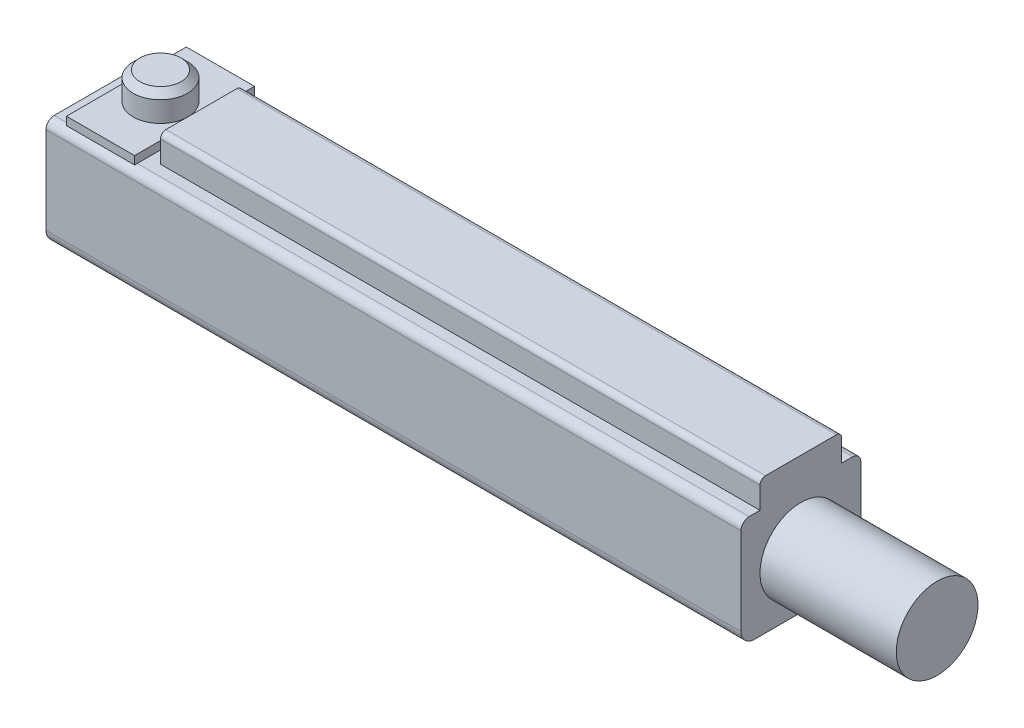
ISO-10303-21;
HEADER;
FILE_DESCRIPTION(('STEP AP214'),'2;1');
FILE_NAME('part.step','',(''),(''),'','','');
FILE_SCHEMA(('AUTOMOTIVE_DESIGN { 1 0 10303 214 1 1 1 1 }'));
ENDSEC;
DATA;
#1=APPLICATION_CONTEXT('core data for automotive mechanical design processes');
#2=APPLICATION_PROTOCOL_DEFINITION('international standard','automotive_design',2000,#1);
#3=PRODUCT_CONTEXT('',#1,'mechanical');
#4=PRODUCT('Part','Part','',(#3));
#5=PRODUCT_RELATED_PRODUCT_CATEGORY('part','',(#4));
#6=PRODUCT_DEFINITION_FORMATION('','',#4);
#7=PRODUCT_DEFINITION_CONTEXT('part definition',#1,'design');
#8=PRODUCT_DEFINITION('design','',#6,#7);
#9=PRODUCT_DEFINITION_SHAPE('','',#8);
#10=(LENGTH_UNIT() NAMED_UNIT(*) SI_UNIT(.MILLI.,.METRE.));
#11=(NAMED_UNIT(*) PLANE_ANGLE_UNIT() SI_UNIT($,.RADIAN.));
#12=(NAMED_UNIT(*) SI_UNIT($,.STERADIAN.) SOLID_ANGLE_UNIT());
#13=UNCERTAINTY_MEASURE_WITH_UNIT(LENGTH_MEASURE(1.E-05),#10,'distance_accuracy_value','');
#14=(GEOMETRIC_REPRESENTATION_CONTEXT(3) GLOBAL_UNCERTAINTY_ASSIGNED_CONTEXT((#13)) GLOBAL_UNIT_ASSIGNED_CONTEXT((#10,
#11,#12)) REPRESENTATION_CONTEXT('',''));
#15=CARTESIAN_POINT('',(0.,0.,0.));
#16=DIRECTION('',(0.,0.,1.));
#17=DIRECTION('',(1.,0.,0.));
#18=AXIS2_PLACEMENT_3D('',#15,#16,#17);
#19=CARTESIAN_POINT('',(2.,3.9,0.));
#20=DIRECTION('',(0.,1.,0.));
#21=DIRECTION('',(0.,0.,1.));
#22=AXIS2_PLACEMENT_3D('',#19,#20,#21);
#23=CYLINDRICAL_SURFACE('',#22,1.);
#24=CARTESIAN_POINT('',(2.,4.,0.));
#25=DIRECTION('',(0.,-1.,0.));
#26=DIRECTION('',(0.,0.,-1.));
#27=AXIS2_PLACEMENT_3D('',#24,#25,#26);
#28=CIRCLE('',#27,1.);
#29=CARTESIAN_POINT('',(2.,4.,-0.999999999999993));
#30=VERTEX_POINT('',#29);
#31=EDGE_CURVE('E184',#30,#30,#28,.F.);
#32=ORIENTED_EDGE('',*,*,#31,.T.);
#33=EDGE_LOOP('',(#32));
#34=FACE_BOUND('',#33,.T.);
#35=CARTESIAN_POINT('',(2.,4.2,0.));
#36=DIRECTION('',(0.,1.,0.));
#37=DIRECTION('',(0.,0.,1.));
#38=AXIS2_PLACEMENT_3D('',#35,#36,#37);
#39=CIRCLE('',#38,1.);
#40=CARTESIAN_POINT('',(2.,4.2,1.00000000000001));
#41=VERTEX_POINT('',#40);
#42=EDGE_CURVE('E11',#41,#41,#39,.T.);
#43=ORIENTED_EDGE('',*,*,#42,.F.);
#44=EDGE_LOOP('',(#43));
#45=FACE_BOUND('',#44,.T.);
#46=ADVANCED_FACE('F16',(#34,#45),#23,.T.);
#47=CARTESIAN_POINT('',(0.,0.5,1.7));
#48=DIRECTION('',(1.,0.,0.));
#49=DIRECTION('',(0.,0.,-1.));
#50=AXIS2_PLACEMENT_3D('',#47,#48,#49);
#51=PLANE('',#50);
#52=DIRECTION('',(0.,0.,1.));
#53=VECTOR('',#52,1.);
#54=CARTESIAN_POINT('',(0.,4.,1.5));
#55=LINE('',#54,#53);
#56=CARTESIAN_POINT('',(0.,4.,-1.9));
#57=VERTEX_POINT('',#56);
#58=CARTESIAN_POINT('',(0.,4.,1.9));
#59=VERTEX_POINT('',#58);
#60=EDGE_CURVE('E126',#57,#59,#55,.T.);
#61=ORIENTED_EDGE('',*,*,#60,.F.);
#62=CARTESIAN_POINT('',(0.,3.7,-1.9));
#63=DIRECTION('',(1.,0.,0.));
#64=DIRECTION('',(0.,0.,-1.));
#65=AXIS2_PLACEMENT_3D('',#62,#63,#64);
#66=CIRCLE('',#65,0.3);
#67=CARTESIAN_POINT('',(0.,3.7,-2.2));
#68=VERTEX_POINT('',#67);
#69=EDGE_CURVE('E146',#68,#57,#66,.T.);
#70=ORIENTED_EDGE('',*,*,#69,.F.);
#71=DIRECTION('',(0.,1.,0.));
#72=VECTOR('',#71,1.);
#73=CARTESIAN_POINT('',(0.,0.5,-2.2));
#74=LINE('',#73,#72);
#75=CARTESIAN_POINT('',(0.,0.5,-2.2));
#76=VERTEX_POINT('',#75);
#77=EDGE_CURVE('E144',#76,#68,#74,.T.);
#78=ORIENTED_EDGE('',*,*,#77,.F.);
#79=CARTESIAN_POINT('',(0.,0.5,-1.7));
#80=DIRECTION('',(1.,0.,0.));
#81=DIRECTION('',(0.,0.,-1.));
#82=AXIS2_PLACEMENT_3D('',#79,#80,#81);
#83=CIRCLE('',#82,0.5);
#84=CARTESIAN_POINT('',(0.,0.,-1.7));
#85=VERTEX_POINT('',#84);
#86=EDGE_CURVE('E142',#85,#76,#83,.T.);
#87=ORIENTED_EDGE('',*,*,#86,.F.);
#88=DIRECTION('',(0.,0.,-1.));
#89=VECTOR('',#88,1.);
#90=CARTESIAN_POINT('',(0.,0.,1.7));
#91=LINE('',#90,#89);
#92=CARTESIAN_POINT('',(0.,0.,1.7));
#93=VERTEX_POINT('',#92);
#94=EDGE_CURVE('E139',#93,#85,#91,.T.);
#95=ORIENTED_EDGE('',*,*,#94,.F.);
#96=CARTESIAN_POINT('',(0.,0.5,1.7));
#97=DIRECTION('',(1.,0.,0.));
#98=DIRECTION('',(0.,0.,-1.));
#99=AXIS2_PLACEMENT_3D('',#96,#97,#98);
#100=CIRCLE('',#99,0.5);
#101=CARTESIAN_POINT('',(0.,0.5,2.2));
#102=VERTEX_POINT('',#101);
#103=EDGE_CURVE('E136',#102,#93,#100,.T.);
#104=ORIENTED_EDGE('',*,*,#103,.F.);
#105=DIRECTION('',(0.,-1.,0.));
#106=VECTOR('',#105,1.);
#107=CARTESIAN_POINT('',(0.,3.7,2.2));
#108=LINE('',#107,#106);
#109=CARTESIAN_POINT('',(0.,3.7,2.2));
#110=VERTEX_POINT('',#109);
#111=EDGE_CURVE('E70',#110,#102,#108,.T.);
#112=ORIENTED_EDGE('',*,*,#111,.F.);
#113=CARTESIAN_POINT('',(0.,3.7,1.9));
#114=DIRECTION('',(1.,0.,0.));
#115=DIRECTION('',(0.,0.,-1.));
#116=AXIS2_PLACEMENT_3D('',#113,#114,#115);
#117=CIRCLE('',#116,0.3);
#118=EDGE_CURVE('E64',#59,#110,#117,.T.);
#119=ORIENTED_EDGE('',*,*,#118,.F.);
#120=EDGE_LOOP('',(#61,#70,#78,#87,#95,#104,#112,#119));
#121=FACE_BOUND('',#120,.T.);
#122=ADVANCED_FACE('F213',(#121),#51,.F.);
#123=CARTESIAN_POINT('',(25.5,0.5,1.7));
#124=DIRECTION('',(-1.,0.,0.));
#125=DIRECTION('',(0.,0.,1.));
#126=AXIS2_PLACEMENT_3D('',#123,#124,#125);
#127=CYLINDRICAL_SURFACE('',#126,0.5);
#128=ORIENTED_EDGE('',*,*,#103,.T.);
#129=DIRECTION('',(-1.,0.,0.));
#130=VECTOR('',#129,1.);
#131=CARTESIAN_POINT('',(25.5,0.,1.7));
#132=LINE('',#131,#130);
#133=CARTESIAN_POINT('',(25.5,0.,1.7));
#134=VERTEX_POINT('',#133);
#135=EDGE_CURVE('E182',#134,#93,#132,.T.);
#136=ORIENTED_EDGE('',*,*,#135,.F.);
#137=CARTESIAN_POINT('',(25.5,0.5,1.7));
#138=DIRECTION('',(1.,0.,0.));
#139=DIRECTION('',(0.,0.,-1.));
#140=AXIS2_PLACEMENT_3D('',#137,#138,#139);
#141=CIRCLE('',#140,0.5);
#142=CARTESIAN_POINT('',(25.5,0.5,2.2));
#143=VERTEX_POINT('',#142);
#144=EDGE_CURVE('E152',#143,#134,#141,.T.);
#145=ORIENTED_EDGE('',*,*,#144,.F.);
#146=DIRECTION('',(-1.,0.,0.));
#147=VECTOR('',#146,1.);
#148=CARTESIAN_POINT('',(25.5,0.5,2.2));
#149=LINE('',#148,#147);
#150=EDGE_CURVE('E132',#143,#102,#149,.T.);
#151=ORIENTED_EDGE('',*,*,#150,.T.);
#152=EDGE_LOOP('',(#128,#136,#145,#151));
#153=FACE_BOUND('',#152,.T.);
#154=ADVANCED_FACE('F18',(#153),#127,.T.);
#155=CARTESIAN_POINT('',(25.5,0.,1.7));
#156=DIRECTION('',(0.,1.,0.));
#157=DIRECTION('',(0.,0.,1.));
#158=AXIS2_PLACEMENT_3D('',#155,#156,#157);
#159=PLANE('',#158);
#160=ORIENTED_EDGE('',*,*,#94,.T.);
#161=DIRECTION('',(-1.,0.,0.));
#162=VECTOR('',#161,1.);
#163=CARTESIAN_POINT('',(25.5,0.,-1.7));
#164=LINE('',#163,#162);
#165=CARTESIAN_POINT('',(25.5,0.,-1.7));
#166=VERTEX_POINT('',#165);
#167=EDGE_CURVE('E179',#166,#85,#164,.T.);
#168=ORIENTED_EDGE('',*,*,#167,.F.);
#169=DIRECTION('',(0.,0.,-1.));
#170=VECTOR('',#169,1.);
#171=CARTESIAN_POINT('',(25.5,0.,1.7));
#172=LINE('',#171,#170);
#173=EDGE_CURVE('E79',#134,#166,#172,.T.);
#174=ORIENTED_EDGE('',*,*,#173,.F.);
#175=ORIENTED_EDGE('',*,*,#135,.T.);
#176=EDGE_LOOP('',(#160,#168,#174,#175));
#177=FACE_BOUND('',#176,.T.);
#178=ADVANCED_FACE('F417',(#177),#159,.F.);
#179=CARTESIAN_POINT('',(25.5,0.5,-1.7));
#180=DIRECTION('',(-1.,0.,0.));
#181=DIRECTION('',(0.,0.,1.));
#182=AXIS2_PLACEMENT_3D('',#179,#180,#181);
#183=CYLINDRICAL_SURFACE('',#182,0.5);
#184=ORIENTED_EDGE('',*,*,#86,.T.);
#185=DIRECTION('',(-1.,0.,0.));
#186=VECTOR('',#185,1.);
#187=CARTESIAN_POINT('',(25.5,0.5,-2.2));
#188=LINE('',#187,#186);
#189=CARTESIAN_POINT('',(25.5,0.5,-2.2));
#190=VERTEX_POINT('',#189);
#191=EDGE_CURVE('E176',#190,#76,#188,.T.);
#192=ORIENTED_EDGE('',*,*,#191,.F.);
#193=CARTESIAN_POINT('',(25.5,0.5,-1.7));
#194=DIRECTION('',(1.,0.,0.));
#195=DIRECTION('',(0.,0.,-1.));
#196=AXIS2_PLACEMENT_3D('',#193,#194,#195);
#197=CIRCLE('',#196,0.5);
#198=EDGE_CURVE('E314',#166,#190,#197,.T.);
#199=ORIENTED_EDGE('',*,*,#198,.F.);
#200=ORIENTED_EDGE('',*,*,#167,.T.);
#201=EDGE_LOOP('',(#184,#192,#199,#200));
#202=FACE_BOUND('',#201,.T.);
#203=ADVANCED_FACE('F414',(#202),#183,.T.);
#204=CARTESIAN_POINT('',(25.5,0.5,-2.2));
#205=DIRECTION('',(0.,0.,1.));
#206=DIRECTION('',(1.,0.,0.));
#207=AXIS2_PLACEMENT_3D('',#204,#205,#206);
#208=PLANE('',#207);
#209=ORIENTED_EDGE('',*,*,#77,.T.);
#210=DIRECTION('',(-1.,0.,0.));
#211=VECTOR('',#210,1.);
#212=CARTESIAN_POINT('',(25.5,3.7,-2.2));
#213=LINE('',#212,#211);
#214=CARTESIAN_POINT('',(25.5,3.7,-2.2));
#215=VERTEX_POINT('',#214);
#216=EDGE_CURVE('E173',#215,#68,#213,.T.);
#217=ORIENTED_EDGE('',*,*,#216,.F.);
#218=DIRECTION('',(0.,1.,0.));
#219=VECTOR('',#218,1.);
#220=CARTESIAN_POINT('',(25.5,0.5,-2.2));
#221=LINE('',#220,#219);
#222=EDGE_CURVE('E316',#190,#215,#221,.T.);
#223=ORIENTED_EDGE('',*,*,#222,.F.);
#224=ORIENTED_EDGE('',*,*,#191,.T.);
#225=EDGE_LOOP('',(#209,#217,#223,#224));
#226=FACE_BOUND('',#225,.T.);
#227=ADVANCED_FACE('F411',(#226),#208,.F.);
#228=CARTESIAN_POINT('',(25.5,3.7,-1.9));
#229=DIRECTION('',(-1.,0.,0.));
#230=DIRECTION('',(0.,0.,1.));
#231=AXIS2_PLACEMENT_3D('',#228,#229,#230);
#232=CYLINDRICAL_SURFACE('',#231,0.3);
#233=ORIENTED_EDGE('',*,*,#69,.T.);
#234=DIRECTION('',(-1.,0.,0.));
#235=VECTOR('',#234,1.);
#236=CARTESIAN_POINT('',(25.5,4.,-1.9));
#237=LINE('',#236,#235);
#238=CARTESIAN_POINT('',(25.5,4.,-1.9));
#239=VERTEX_POINT('',#238);
#240=EDGE_CURVE('E171',#239,#57,#237,.T.);
#241=ORIENTED_EDGE('',*,*,#240,.F.);
#242=CARTESIAN_POINT('',(25.5,3.7,-1.9));
#243=DIRECTION('',(1.,0.,0.));
#244=DIRECTION('',(0.,0.,-1.));
#245=AXIS2_PLACEMENT_3D('',#242,#243,#244);
#246=CIRCLE('',#245,0.3);
#247=EDGE_CURVE('E318',#215,#239,#246,.T.);
#248=ORIENTED_EDGE('',*,*,#247,.F.);
#249=ORIENTED_EDGE('',*,*,#216,.T.);
#250=EDGE_LOOP('',(#233,#241,#248,#249));
#251=FACE_BOUND('',#250,.T.);
#252=ADVANCED_FACE('F375',(#251),#232,.T.);
#253=CARTESIAN_POINT('',(25.5,4.,-1.5));
#254=DIRECTION('',(0.,0.,1.));
#255=DIRECTION('',(0.,-1.,0.));
#256=AXIS2_PLACEMENT_3D('',#253,#254,#255);
#257=PLANE('',#256);
#258=DIRECTION('',(-1.,0.,0.));
#259=VECTOR('',#258,1.);
#260=CARTESIAN_POINT('',(25.5,4.,-1.5));
#261=LINE('',#260,#259);
#262=CARTESIAN_POINT('',(25.5,4.,-1.5));
#263=VERTEX_POINT('',#262);
#264=CARTESIAN_POINT('',(3.5,4.,-1.5));
#265=VERTEX_POINT('',#264);
#266=EDGE_CURVE('E168',#263,#265,#261,.T.);
#267=ORIENTED_EDGE('',*,*,#266,.T.);
#268=DIRECTION('',(0.,1.,0.));
#269=VECTOR('',#268,1.);
#270=CARTESIAN_POINT('',(3.5,4.,-1.5));
#271=LINE('',#270,#269);
#272=CARTESIAN_POINT('',(3.5,4.8,-1.5));
#273=VERTEX_POINT('',#272);
#274=EDGE_CURVE('E301',#265,#273,#271,.T.);
#275=ORIENTED_EDGE('',*,*,#274,.T.);
#276=DIRECTION('',(-1.,0.,0.));
#277=VECTOR('',#276,1.);
#278=CARTESIAN_POINT('',(25.5,4.8,-1.5));
#279=LINE('',#278,#277);
#280=CARTESIAN_POINT('',(25.5,4.8,-1.5));
#281=VERTEX_POINT('',#280);
#282=EDGE_CURVE('E165',#281,#273,#279,.T.);
#283=ORIENTED_EDGE('',*,*,#282,.F.);
#284=DIRECTION('',(0.,1.,0.));
#285=VECTOR('',#284,1.);
#286=CARTESIAN_POINT('',(25.5,4.,-1.5));
#287=LINE('',#286,#285);
#288=EDGE_CURVE('E322',#263,#281,#287,.T.);
#289=ORIENTED_EDGE('',*,*,#288,.F.);
#290=EDGE_LOOP('',(#267,#275,#283,#289));
#291=FACE_BOUND('',#290,.T.);
#292=ADVANCED_FACE('F368',(#291),#257,.F.);
#293=CARTESIAN_POINT('',(25.5,4.8,-1.3));
#294=DIRECTION('',(-1.,0.,0.));
#295=DIRECTION('',(0.,0.,1.));
#296=AXIS2_PLACEMENT_3D('',#293,#294,#295);
#297=CYLINDRICAL_SURFACE('',#296,0.2);
#298=ORIENTED_EDGE('',*,*,#282,.T.);
#299=CARTESIAN_POINT('',(3.5,4.8,-1.3));
#300=DIRECTION('',(1.,0.,0.));
#301=DIRECTION('',(0.,0.,-1.));
#302=AXIS2_PLACEMENT_3D('',#299,#300,#301);
#303=CIRCLE('',#302,0.2);
#304=CARTESIAN_POINT('',(3.5,5.,-1.3));
#305=VERTEX_POINT('',#304);
#306=EDGE_CURVE('E140',#273,#305,#303,.T.);
#307=ORIENTED_EDGE('',*,*,#306,.T.);
#308=DIRECTION('',(-1.,0.,0.));
#309=VECTOR('',#308,1.);
#310=CARTESIAN_POINT('',(25.5,5.,-1.3));
#311=LINE('',#310,#309);
#312=CARTESIAN_POINT('',(25.5,5.,-1.3));
#313=VERTEX_POINT('',#312);
#314=EDGE_CURVE('E162',#313,#305,#311,.T.);
#315=ORIENTED_EDGE('',*,*,#314,.F.);
#316=CARTESIAN_POINT('',(25.5,4.8,-1.3));
#317=DIRECTION('',(1.,0.,0.));
#318=DIRECTION('',(0.,0.,-1.));
#319=AXIS2_PLACEMENT_3D('',#316,#317,#318);
#320=CIRCLE('',#319,0.2);
#321=EDGE_CURVE('E324',#281,#313,#320,.T.);
#322=ORIENTED_EDGE('',*,*,#321,.F.);
#323=EDGE_LOOP('',(#298,#307,#315,#322));
#324=FACE_BOUND('',#323,.T.);
#325=ADVANCED_FACE('F364',(#324),#297,.T.);
#326=CARTESIAN_POINT('',(25.5,5.,-1.3));
#327=DIRECTION('',(0.,-1.,0.));
#328=DIRECTION('',(0.,0.,-1.));
#329=AXIS2_PLACEMENT_3D('',#326,#327,#328);
#330=PLANE('',#329);
#331=ORIENTED_EDGE('',*,*,#314,.T.);
#332=DIRECTION('',(0.,0.,1.));
#333=VECTOR('',#332,1.);
#334=CARTESIAN_POINT('',(3.5,5.,-1.5));
#335=LINE('',#334,#333);
#336=CARTESIAN_POINT('',(3.5,5.,1.3));
#337=VERTEX_POINT('',#336);
#338=EDGE_CURVE('E304',#305,#337,#335,.T.);
#339=ORIENTED_EDGE('',*,*,#338,.T.);
#340=DIRECTION('',(-1.,0.,0.));
#341=VECTOR('',#340,1.);
#342=CARTESIAN_POINT('',(25.5,5.,1.3));
#343=LINE('',#342,#341);
#344=CARTESIAN_POINT('',(25.5,5.,1.3));
#345=VERTEX_POINT('',#344);
#346=EDGE_CURVE('E159',#345,#337,#343,.T.);
#347=ORIENTED_EDGE('',*,*,#346,.F.);
#348=DIRECTION('',(0.,0.,1.));
#349=VECTOR('',#348,1.);
#350=CARTESIAN_POINT('',(25.5,5.,-1.3));
#351=LINE('',#350,#349);
#352=EDGE_CURVE('E326',#313,#345,#351,.T.);
#353=ORIENTED_EDGE('',*,*,#352,.F.);
#354=EDGE_LOOP('',(#331,#339,#347,#353));
#355=FACE_BOUND('',#354,.T.);
#356=ADVANCED_FACE('F360',(#355),#330,.F.);
#357=CARTESIAN_POINT('',(25.5,4.8,1.3));
#358=DIRECTION('',(-1.,0.,0.));
#359=DIRECTION('',(0.,0.,1.));
#360=AXIS2_PLACEMENT_3D('',#357,#358,#359);
#361=CYLINDRICAL_SURFACE('',#360,0.2);
#362=ORIENTED_EDGE('',*,*,#346,.T.);
#363=CARTESIAN_POINT('',(3.5,4.8,1.3));
#364=DIRECTION('',(1.,0.,0.));
#365=DIRECTION('',(0.,0.,-1.));
#366=AXIS2_PLACEMENT_3D('',#363,#364,#365);
#367=CIRCLE('',#366,0.2);
#368=CARTESIAN_POINT('',(3.5,4.8,1.5));
#369=VERTEX_POINT('',#368);
#370=EDGE_CURVE('E307',#337,#369,#367,.T.);
#371=ORIENTED_EDGE('',*,*,#370,.T.);
#372=DIRECTION('',(-1.,0.,0.));
#373=VECTOR('',#372,1.);
#374=CARTESIAN_POINT('',(25.5,4.8,1.5));
#375=LINE('',#374,#373);
#376=CARTESIAN_POINT('',(25.5,4.8,1.5));
#377=VERTEX_POINT('',#376);
#378=EDGE_CURVE('E156',#377,#369,#375,.T.);
#379=ORIENTED_EDGE('',*,*,#378,.F.);
#380=CARTESIAN_POINT('',(25.5,4.8,1.3));
#381=DIRECTION('',(1.,0.,0.));
#382=DIRECTION('',(0.,0.,-1.));
#383=AXIS2_PLACEMENT_3D('',#380,#381,#382);
#384=CIRCLE('',#383,0.2);
#385=EDGE_CURVE('E328',#345,#377,#384,.T.);
#386=ORIENTED_EDGE('',*,*,#385,.F.);
#387=EDGE_LOOP('',(#362,#371,#379,#386));
#388=FACE_BOUND('',#387,.T.);
#389=ADVANCED_FACE('F334',(#388),#361,.T.);
#390=CARTESIAN_POINT('',(25.5,4.8,1.5));
#391=DIRECTION('',(0.,0.,-1.));
#392=DIRECTION('',(-1.,0.,0.));
#393=AXIS2_PLACEMENT_3D('',#390,#391,#392);
#394=PLANE('',#393);
#395=ORIENTED_EDGE('',*,*,#378,.T.);
#396=DIRECTION('',(0.,-1.,0.));
#397=VECTOR('',#396,1.);
#398=CARTESIAN_POINT('',(3.5,5.,1.5));
#399=LINE('',#398,#397);
#400=CARTESIAN_POINT('',(3.5,4.,1.5));
#401=VERTEX_POINT('',#400);
#402=EDGE_CURVE('E295',#369,#401,#399,.T.);
#403=ORIENTED_EDGE('',*,*,#402,.T.);
#404=DIRECTION('',(-1.,0.,0.));
#405=VECTOR('',#404,1.);
#406=CARTESIAN_POINT('',(25.5,4.,1.5));
#407=LINE('',#406,#405);
#408=CARTESIAN_POINT('',(25.5,4.,1.5));
#409=VERTEX_POINT('',#408);
#410=EDGE_CURVE('E127',#409,#401,#407,.T.);
#411=ORIENTED_EDGE('',*,*,#410,.F.);
#412=DIRECTION('',(0.,-1.,0.));
#413=VECTOR('',#412,1.);
#414=CARTESIAN_POINT('',(25.5,4.8,1.5));
#415=LINE('',#414,#413);
#416=EDGE_CURVE('E118',#377,#409,#415,.T.);
#417=ORIENTED_EDGE('',*,*,#416,.F.);
#418=EDGE_LOOP('',(#395,#403,#411,#417));
#419=FACE_BOUND('',#418,.T.);
#420=ADVANCED_FACE('F337',(#419),#394,.F.);
#421=CARTESIAN_POINT('',(25.5,4.,1.5));
#422=DIRECTION('',(0.,-1.,0.));
#423=DIRECTION('',(0.,0.,-1.));
#424=AXIS2_PLACEMENT_3D('',#421,#422,#423);
#425=PLANE('',#424);
#426=ORIENTED_EDGE('',*,*,#31,.F.);
#427=EDGE_LOOP('',(#426));
#428=FACE_BOUND('',#427,.T.);
#429=ORIENTED_EDGE('',*,*,#60,.T.);
#430=DIRECTION('',(-1.,0.,0.));
#431=VECTOR('',#430,1.);
#432=CARTESIAN_POINT('',(25.5,4.,1.9));
#433=LINE('',#432,#431);
#434=CARTESIAN_POINT('',(25.5,4.,1.9));
#435=VERTEX_POINT('',#434);
#436=EDGE_CURVE('E123',#435,#59,#433,.T.);
#437=ORIENTED_EDGE('',*,*,#436,.F.);
#438=DIRECTION('',(0.,0.,1.));
#439=VECTOR('',#438,1.);
#440=CARTESIAN_POINT('',(25.5,4.,1.5));
#441=LINE('',#440,#439);
#442=EDGE_CURVE('E112',#409,#435,#441,.T.);
#443=ORIENTED_EDGE('',*,*,#442,.F.);
#444=ORIENTED_EDGE('',*,*,#410,.T.);
#445=DIRECTION('',(0.,0.,-1.));
#446=VECTOR('',#445,1.);
#447=CARTESIAN_POINT('',(3.5,4.,1.5));
#448=LINE('',#447,#446);
#449=EDGE_CURVE('E298',#401,#265,#448,.T.);
#450=ORIENTED_EDGE('',*,*,#449,.T.);
#451=ORIENTED_EDGE('',*,*,#266,.F.);
#452=DIRECTION('',(0.,0.,1.));
#453=VECTOR('',#452,1.);
#454=CARTESIAN_POINT('',(25.5,4.,-1.9));
#455=LINE('',#454,#453);
#456=EDGE_CURVE('E320',#239,#263,#455,.T.);
#457=ORIENTED_EDGE('',*,*,#456,.F.);
#458=ORIENTED_EDGE('',*,*,#240,.T.);
#459=EDGE_LOOP('',(#429,#437,#443,#444,#450,#451,#457,#458));
#460=FACE_BOUND('',#459,.T.);
#461=ADVANCED_FACE('F124',(#428,#460),#425,.F.);
#462=CARTESIAN_POINT('',(25.5,3.7,1.9));
#463=DIRECTION('',(-1.,0.,0.));
#464=DIRECTION('',(0.,0.,1.));
#465=AXIS2_PLACEMENT_3D('',#462,#463,#464);
#466=CYLINDRICAL_SURFACE('',#465,0.3);
#467=ORIENTED_EDGE('',*,*,#118,.T.);
#468=DIRECTION('',(-1.,0.,0.));
#469=VECTOR('',#468,1.);
#470=CARTESIAN_POINT('',(25.5,3.7,2.2));
#471=LINE('',#470,#469);
#472=CARTESIAN_POINT('',(25.5,3.7,2.2));
#473=VERTEX_POINT('',#472);
#474=EDGE_CURVE('E128',#473,#110,#471,.T.);
#475=ORIENTED_EDGE('',*,*,#474,.F.);
#476=CARTESIAN_POINT('',(25.5,3.7,1.9));
#477=DIRECTION('',(1.,0.,0.));
#478=DIRECTION('',(0.,0.,-1.));
#479=AXIS2_PLACEMENT_3D('',#476,#477,#478);
#480=CIRCLE('',#479,0.3);
#481=EDGE_CURVE('E116',#435,#473,#480,.T.);
#482=ORIENTED_EDGE('',*,*,#481,.F.);
#483=ORIENTED_EDGE('',*,*,#436,.T.);
#484=EDGE_LOOP('',(#467,#475,#482,#483));
#485=FACE_BOUND('',#484,.T.);
#486=ADVANCED_FACE('F130',(#485),#466,.T.);
#487=CARTESIAN_POINT('',(25.5,3.7,2.2));
#488=DIRECTION('',(0.,0.,-1.));
#489=DIRECTION('',(-1.,0.,0.));
#490=AXIS2_PLACEMENT_3D('',#487,#488,#489);
#491=PLANE('',#490);
#492=ORIENTED_EDGE('',*,*,#111,.T.);
#493=ORIENTED_EDGE('',*,*,#150,.F.);
#494=DIRECTION('',(0.,-1.,0.));
#495=VECTOR('',#494,1.);
#496=CARTESIAN_POINT('',(25.5,3.7,2.2));
#497=LINE('',#496,#495);
#498=EDGE_CURVE('E34',#473,#143,#497,.T.);
#499=ORIENTED_EDGE('',*,*,#498,.F.);
#500=ORIENTED_EDGE('',*,*,#474,.T.);
#501=EDGE_LOOP('',(#492,#493,#499,#500));
#502=FACE_BOUND('',#501,.T.);
#503=ADVANCED_FACE('F383',(#502),#491,.F.);
#504=CARTESIAN_POINT('',(25.5,0.5,1.7));
#505=DIRECTION('',(1.,0.,0.));
#506=DIRECTION('',(0.,0.,-1.));
#507=AXIS2_PLACEMENT_3D('',#504,#505,#506);
#508=PLANE('',#507);
#509=CARTESIAN_POINT('',(25.5,2.,0.));
#510=DIRECTION('',(1.,0.,0.));
#511=DIRECTION('',(0.,0.,-1.));
#512=AXIS2_PLACEMENT_3D('',#509,#510,#511);
#513=CIRCLE('',#512,1.5);
#514=CARTESIAN_POINT('',(25.5,2.,-1.5));
#515=VERTEX_POINT('',#514);
#516=EDGE_CURVE('E20',#515,#515,#513,.F.);
#517=ORIENTED_EDGE('',*,*,#516,.T.);
#518=EDGE_LOOP('',(#517));
#519=FACE_BOUND('',#518,.T.);
#520=ORIENTED_EDGE('',*,*,#144,.T.);
#521=ORIENTED_EDGE('',*,*,#173,.T.);
#522=ORIENTED_EDGE('',*,*,#198,.T.);
#523=ORIENTED_EDGE('',*,*,#222,.T.);
#524=ORIENTED_EDGE('',*,*,#247,.T.);
#525=ORIENTED_EDGE('',*,*,#456,.T.);
#526=ORIENTED_EDGE('',*,*,#288,.T.);
#527=ORIENTED_EDGE('',*,*,#321,.T.);
#528=ORIENTED_EDGE('',*,*,#352,.T.);
#529=ORIENTED_EDGE('',*,*,#385,.T.);
#530=ORIENTED_EDGE('',*,*,#416,.T.);
#531=ORIENTED_EDGE('',*,*,#442,.T.);
#532=ORIENTED_EDGE('',*,*,#481,.T.);
#533=ORIENTED_EDGE('',*,*,#498,.T.);
#534=EDGE_LOOP('',(#520,#521,#522,#523,#524,#525,#526,#527,#528,#529,#530,#531,#532,#533));
#535=FACE_BOUND('',#534,.T.);
#536=ADVANCED_FACE('F114',(#519,#535),#508,.T.);
#537=CARTESIAN_POINT('',(3.5,0.,0.));
#538=DIRECTION('',(1.,0.,0.));
#539=DIRECTION('',(0.,0.,-1.));
#540=AXIS2_PLACEMENT_3D('',#537,#538,#539);
#541=PLANE('',#540);
#542=ORIENTED_EDGE('',*,*,#274,.F.);
#543=ORIENTED_EDGE('',*,*,#449,.F.);
#544=ORIENTED_EDGE('',*,*,#402,.F.);
#545=ORIENTED_EDGE('',*,*,#370,.F.);
#546=ORIENTED_EDGE('',*,*,#338,.F.);
#547=ORIENTED_EDGE('',*,*,#306,.F.);
#548=EDGE_LOOP('',(#542,#543,#544,#545,#546,#547));
#549=FACE_BOUND('',#548,.T.);
#550=ADVANCED_FACE('F358',(#549),#541,.F.);
#551=CARTESIAN_POINT('',(3.25,4.5,2.2));
#552=DIRECTION('',(0.,0.,-1.));
#553=DIRECTION('',(-1.,0.,0.));
#554=AXIS2_PLACEMENT_3D('',#551,#552,#553);
#555=PLANE('',#554);
#556=DIRECTION('',(-1.,0.,0.));
#557=VECTOR('',#556,1.);
#558=CARTESIAN_POINT('',(3.25,4.5,2.2));
#559=LINE('',#558,#557);
#560=CARTESIAN_POINT('',(3.25,4.5,2.2));
#561=VERTEX_POINT('',#560);
#562=CARTESIAN_POINT('',(0.75,4.5,2.2));
#563=VERTEX_POINT('',#562);
#564=EDGE_CURVE('E266',#561,#563,#559,.T.);
#565=ORIENTED_EDGE('',*,*,#564,.T.);
#566=DIRECTION('',(0.,-1.,0.));
#567=VECTOR('',#566,1.);
#568=CARTESIAN_POINT('',(0.75,4.5,2.2));
#569=LINE('',#568,#567);
#570=CARTESIAN_POINT('',(0.75,4.2,2.2));
#571=VERTEX_POINT('',#570);
#572=EDGE_CURVE('E259',#563,#571,#569,.T.);
#573=ORIENTED_EDGE('',*,*,#572,.T.);
#574=DIRECTION('',(-1.,0.,0.));
#575=VECTOR('',#574,1.);
#576=CARTESIAN_POINT('',(3.25,4.2,2.2));
#577=LINE('',#576,#575);
#578=CARTESIAN_POINT('',(3.25,4.2,2.2));
#579=VERTEX_POINT('',#578);
#580=EDGE_CURVE('E237',#579,#571,#577,.T.);
#581=ORIENTED_EDGE('',*,*,#580,.F.);
#582=DIRECTION('',(0.,-1.,0.));
#583=VECTOR('',#582,1.);
#584=CARTESIAN_POINT('',(3.25,4.5,2.2));
#585=LINE('',#584,#583);
#586=EDGE_CURVE('E275',#561,#579,#585,.T.);
#587=ORIENTED_EDGE('',*,*,#586,.F.);
#588=EDGE_LOOP('',(#565,#573,#581,#587));
#589=FACE_BOUND('',#588,.T.);
#590=ADVANCED_FACE('F230',(#589),#555,.F.);
#591=CARTESIAN_POINT('',(3.25,4.2,2.2));
#592=DIRECTION('',(0.,1.,0.));
#593=DIRECTION('',(0.,0.,1.));
#594=AXIS2_PLACEMENT_3D('',#591,#592,#593);
#595=PLANE('',#594);
#596=ORIENTED_EDGE('',*,*,#42,.T.);
#597=EDGE_LOOP('',(#596));
#598=FACE_BOUND('',#597,.T.);
#599=ORIENTED_EDGE('',*,*,#580,.T.);
#600=DIRECTION('',(0.,0.,-1.));
#601=VECTOR('',#600,1.);
#602=CARTESIAN_POINT('',(0.75,4.2,2.2));
#603=LINE('',#602,#601);
#604=CARTESIAN_POINT('',(0.75,4.2,-2.2));
#605=VERTEX_POINT('',#604);
#606=EDGE_CURVE('E241',#571,#605,#603,.T.);
#607=ORIENTED_EDGE('',*,*,#606,.T.);
#608=DIRECTION('',(-1.,0.,0.));
#609=VECTOR('',#608,1.);
#610=CARTESIAN_POINT('',(3.25,4.2,-2.2));
#611=LINE('',#610,#609);
#612=CARTESIAN_POINT('',(3.25,4.2,-2.2));
#613=VERTEX_POINT('',#612);
#614=EDGE_CURVE('E251',#613,#605,#611,.T.);
#615=ORIENTED_EDGE('',*,*,#614,.F.);
#616=DIRECTION('',(0.,0.,-1.));
#617=VECTOR('',#616,1.);
#618=CARTESIAN_POINT('',(3.25,4.2,2.2));
#619=LINE('',#618,#617);
#620=EDGE_CURVE('E244',#579,#613,#619,.T.);
#621=ORIENTED_EDGE('',*,*,#620,.F.);
#622=EDGE_LOOP('',(#599,#607,#615,#621));
#623=FACE_BOUND('',#622,.T.);
#624=ADVANCED_FACE('F226',(#598,#623),#595,.F.);
#625=CARTESIAN_POINT('',(3.25,4.2,-2.2));
#626=DIRECTION('',(0.,0.,1.));
#627=DIRECTION('',(1.,0.,0.));
#628=AXIS2_PLACEMENT_3D('',#625,#626,#627);
#629=PLANE('',#628);
#630=ORIENTED_EDGE('',*,*,#614,.T.);
#631=DIRECTION('',(0.,1.,0.));
#632=VECTOR('',#631,1.);
#633=CARTESIAN_POINT('',(0.75,4.2,-2.2));
#634=LINE('',#633,#632);
#635=CARTESIAN_POINT('',(0.75,4.5,-2.2));
#636=VERTEX_POINT('',#635);
#637=EDGE_CURVE('E262',#605,#636,#634,.T.);
#638=ORIENTED_EDGE('',*,*,#637,.T.);
#639=DIRECTION('',(-1.,0.,0.));
#640=VECTOR('',#639,1.);
#641=CARTESIAN_POINT('',(3.25,4.5,-2.2));
#642=LINE('',#641,#640);
#643=CARTESIAN_POINT('',(3.25,4.5,-2.2));
#644=VERTEX_POINT('',#643);
#645=EDGE_CURVE('E285',#644,#636,#642,.T.);
#646=ORIENTED_EDGE('',*,*,#645,.F.);
#647=DIRECTION('',(0.,1.,0.));
#648=VECTOR('',#647,1.);
#649=CARTESIAN_POINT('',(3.25,4.2,-2.2));
#650=LINE('',#649,#648);
#651=EDGE_CURVE('E278',#613,#644,#650,.T.);
#652=ORIENTED_EDGE('',*,*,#651,.F.);
#653=EDGE_LOOP('',(#630,#638,#646,#652));
#654=FACE_BOUND('',#653,.T.);
#655=ADVANCED_FACE('F229',(#654),#629,.F.);
#656=CARTESIAN_POINT('',(3.25,4.5,-2.2));
#657=DIRECTION('',(0.,-1.,0.));
#658=DIRECTION('',(0.,0.,-1.));
#659=AXIS2_PLACEMENT_3D('',#656,#657,#658);
#660=PLANE('',#659);
#661=CARTESIAN_POINT('',(2.,4.5,0.));
#662=DIRECTION('',(0.,-1.,0.));
#663=DIRECTION('',(0.,0.,-1.));
#664=AXIS2_PLACEMENT_3D('',#661,#662,#663);
#665=CIRCLE('',#664,1.);
#666=CARTESIAN_POINT('',(2.,4.5,-0.999999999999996));
#667=VERTEX_POINT('',#666);
#668=EDGE_CURVE('E26',#667,#667,#665,.T.);
#669=ORIENTED_EDGE('',*,*,#668,.T.);
#670=EDGE_LOOP('',(#669));
#671=FACE_BOUND('',#670,.T.);
#672=ORIENTED_EDGE('',*,*,#645,.T.);
#673=DIRECTION('',(0.,0.,1.));
#674=VECTOR('',#673,1.);
#675=CARTESIAN_POINT('',(0.75,4.5,-2.2));
#676=LINE('',#675,#674);
#677=EDGE_CURVE('E273',#636,#563,#676,.T.);
#678=ORIENTED_EDGE('',*,*,#677,.T.);
#679=ORIENTED_EDGE('',*,*,#564,.F.);
#680=DIRECTION('',(0.,0.,1.));
#681=VECTOR('',#680,1.);
#682=CARTESIAN_POINT('',(3.25,4.5,-2.2));
#683=LINE('',#682,#681);
#684=EDGE_CURVE('E281',#644,#561,#683,.T.);
#685=ORIENTED_EDGE('',*,*,#684,.F.);
#686=EDGE_LOOP('',(#672,#678,#679,#685));
#687=FACE_BOUND('',#686,.T.);
#688=ADVANCED_FACE('F190',(#671,#687),#660,.F.);
#689=CARTESIAN_POINT('',(3.25,0.,0.));
#690=DIRECTION('',(1.,0.,0.));
#691=DIRECTION('',(0.,0.,-1.));
#692=AXIS2_PLACEMENT_3D('',#689,#690,#691);
#693=PLANE('',#692);
#694=ORIENTED_EDGE('',*,*,#586,.T.);
#695=ORIENTED_EDGE('',*,*,#620,.T.);
#696=ORIENTED_EDGE('',*,*,#651,.T.);
#697=ORIENTED_EDGE('',*,*,#684,.T.);
#698=EDGE_LOOP('',(#694,#695,#696,#697));
#699=FACE_BOUND('',#698,.T.);
#700=ADVANCED_FACE('F561',(#699),#693,.T.);
#701=CARTESIAN_POINT('',(0.75,0.,0.));
#702=DIRECTION('',(1.,0.,0.));
#703=DIRECTION('',(0.,0.,-1.));
#704=AXIS2_PLACEMENT_3D('',#701,#702,#703);
#705=PLANE('',#704);
#706=ORIENTED_EDGE('',*,*,#572,.F.);
#707=ORIENTED_EDGE('',*,*,#677,.F.);
#708=ORIENTED_EDGE('',*,*,#637,.F.);
#709=ORIENTED_EDGE('',*,*,#606,.F.);
#710=EDGE_LOOP('',(#706,#707,#708,#709));
#711=FACE_BOUND('',#710,.T.);
#712=ADVANCED_FACE('F256',(#711),#705,.F.);
#713=CARTESIAN_POINT('',(2.,5.5,0.));
#714=DIRECTION('',(0.,-1.,0.));
#715=DIRECTION('',(0.,0.,-1.));
#716=AXIS2_PLACEMENT_3D('',#713,#714,#715);
#717=PLANE('',#716);
#718=CARTESIAN_POINT('',(2.,5.5,0.));
#719=DIRECTION('',(0.,1.,0.));
#720=DIRECTION('',(0.,0.,1.));
#721=AXIS2_PLACEMENT_3D('',#718,#719,#720);
#722=CIRCLE('',#721,0.7545);
#723=CARTESIAN_POINT('',(2.,5.5,0.7545));
#724=VERTEX_POINT('',#723);
#725=EDGE_CURVE('E292',#724,#724,#722,.T.);
#726=ORIENTED_EDGE('',*,*,#725,.T.);
#727=EDGE_LOOP('',(#726));
#728=FACE_BOUND('',#727,.T.);
#729=ADVANCED_FACE('F207',(#728),#717,.F.);
#730=CARTESIAN_POINT('',(2.,5.2545,0.));
#731=DIRECTION('',(0.,-1.,0.));
#732=DIRECTION('',(0.,0.,-1.));
#733=AXIS2_PLACEMENT_3D('',#730,#731,#732);
#734=CONICAL_SURFACE('',#733,1.,0.785398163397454);
#735=ORIENTED_EDGE('',*,*,#725,.F.);
#736=EDGE_LOOP('',(#735));
#737=FACE_BOUND('',#736,.T.);
#738=CARTESIAN_POINT('',(2.,5.2545,0.));
#739=DIRECTION('',(0.,1.,0.));
#740=DIRECTION('',(0.,0.,1.));
#741=AXIS2_PLACEMENT_3D('',#738,#739,#740);
#742=CIRCLE('',#741,1.);
#743=CARTESIAN_POINT('',(2.,5.2545,1.));
#744=VERTEX_POINT('',#743);
#745=EDGE_CURVE('E250',#744,#744,#742,.T.);
#746=ORIENTED_EDGE('',*,*,#745,.T.);
#747=EDGE_LOOP('',(#746));
#748=FACE_BOUND('',#747,.T.);
#749=ADVANCED_FACE('F196',(#737,#748),#734,.T.);
#750=ORIENTED_EDGE('',*,*,#745,.F.);
#751=EDGE_LOOP('',(#750));
#752=FACE_BOUND('',#751,.T.);
#753=ORIENTED_EDGE('',*,*,#668,.F.);
#754=EDGE_LOOP('',(#753));
#755=FACE_BOUND('',#754,.T.);
#756=ADVANCED_FACE('F193',(#752,#755),#23,.T.);
#757=CARTESIAN_POINT('',(30.5,2.,0.));
#758=DIRECTION('',(-1.,0.,0.));
#759=DIRECTION('',(0.,0.,1.));
#760=AXIS2_PLACEMENT_3D('',#757,#758,#759);
#761=CYLINDRICAL_SURFACE('',#760,1.5);
#762=ORIENTED_EDGE('',*,*,#516,.F.);
#763=EDGE_LOOP('',(#762));
#764=FACE_BOUND('',#763,.T.);
#765=CARTESIAN_POINT('',(30.5,2.,0.));
#766=DIRECTION('',(1.,0.,0.));
#767=DIRECTION('',(0.,0.,-1.));
#768=AXIS2_PLACEMENT_3D('',#765,#766,#767);
#769=CIRCLE('',#768,1.5);
#770=CARTESIAN_POINT('',(30.5,2.,-1.5));
#771=VERTEX_POINT('',#770);
#772=EDGE_CURVE('E269',#771,#771,#769,.T.);
#773=ORIENTED_EDGE('',*,*,#772,.F.);
#774=EDGE_LOOP('',(#773));
#775=FACE_BOUND('',#774,.T.);
#776=ADVANCED_FACE('F195',(#764,#775),#761,.T.);
#777=CARTESIAN_POINT('',(30.5,2.,0.));
#778=DIRECTION('',(1.,0.,0.));
#779=DIRECTION('',(0.,0.,-1.));
#780=AXIS2_PLACEMENT_3D('',#777,#778,#779);
#781=PLANE('',#780);
#782=ORIENTED_EDGE('',*,*,#772,.T.);
#783=EDGE_LOOP('',(#782));
#784=FACE_BOUND('',#783,.T.);
#785=ADVANCED_FACE('F204',(#784),#781,.T.);
#786=CLOSED_SHELL('',(#46,#122,#154,#178,#203,#227,#252,#292,#325,#356,#389,#420,#461,#486,#503,
#536,#550,#590,#624,#655,#688,#700,#712,#729,#749,#756,#776,#785));
#787=MANIFOLD_SOLID_BREP('B1',#786);
#788=ADVANCED_BREP_SHAPE_REPRESENTATION('',(#18,#787),#14);
#789=SHAPE_DEFINITION_REPRESENTATION(#9,#788);
ENDSEC;
END-ISO-10303-21;
